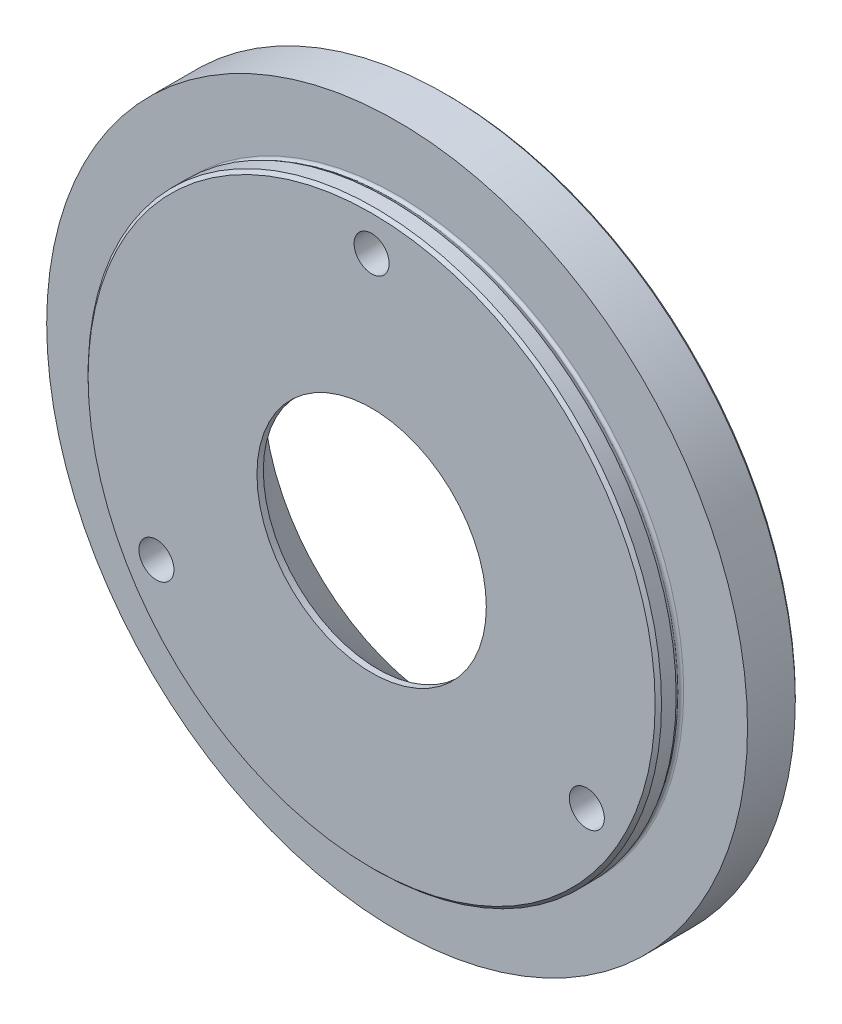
ISO-10303-21;
HEADER;
FILE_DESCRIPTION(('STEP AP214'),'2;1');
FILE_NAME('part.step','',(''),(''),'','','');
FILE_SCHEMA(('AUTOMOTIVE_DESIGN { 1 0 10303 214 1 1 1 1 }'));
ENDSEC;
DATA;
#1=APPLICATION_CONTEXT('core data for automotive mechanical design processes');
#2=APPLICATION_PROTOCOL_DEFINITION('international standard','automotive_design',2000,#1);
#3=PRODUCT_CONTEXT('',#1,'mechanical');
#4=PRODUCT('Part','Part','',(#3));
#5=PRODUCT_RELATED_PRODUCT_CATEGORY('part','',(#4));
#6=PRODUCT_DEFINITION_FORMATION('','',#4);
#7=PRODUCT_DEFINITION_CONTEXT('part definition',#1,'design');
#8=PRODUCT_DEFINITION('design','',#6,#7);
#9=PRODUCT_DEFINITION_SHAPE('','',#8);
#10=(LENGTH_UNIT() NAMED_UNIT(*) SI_UNIT(.MILLI.,.METRE.));
#11=(NAMED_UNIT(*) PLANE_ANGLE_UNIT() SI_UNIT($,.RADIAN.));
#12=(NAMED_UNIT(*) SI_UNIT($,.STERADIAN.) SOLID_ANGLE_UNIT());
#13=UNCERTAINTY_MEASURE_WITH_UNIT(LENGTH_MEASURE(1.E-05),#10,'distance_accuracy_value','');
#14=(GEOMETRIC_REPRESENTATION_CONTEXT(3) GLOBAL_UNCERTAINTY_ASSIGNED_CONTEXT((#13)) GLOBAL_UNIT_ASSIGNED_CONTEXT((#10,
#11,#12)) REPRESENTATION_CONTEXT('',''));
#15=CARTESIAN_POINT('',(0.,0.,0.));
#16=DIRECTION('',(0.,0.,1.));
#17=DIRECTION('',(1.,0.,0.));
#18=AXIS2_PLACEMENT_3D('',#15,#16,#17);
#19=CARTESIAN_POINT('',(0.,0.,4.));
#20=DIRECTION('',(0.,0.,1.));
#21=DIRECTION('',(1.,0.,0.));
#22=AXIS2_PLACEMENT_3D('',#19,#20,#21);
#23=CYLINDRICAL_SURFACE('',#22,45.);
#24=CARTESIAN_POINT('',(0.,0.,3.49999999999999));
#25=DIRECTION('',(0.,0.,1.));
#26=DIRECTION('',(1.,0.,0.));
#27=AXIS2_PLACEMENT_3D('',#24,#25,#26);
#28=CIRCLE('',#27,45.);
#29=CARTESIAN_POINT('',(45.,0.,3.49999999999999));
#30=VERTEX_POINT('',#29);
#31=EDGE_CURVE('E47',#30,#30,#28,.T.);
#32=ORIENTED_EDGE('',*,*,#31,.F.);
#33=EDGE_LOOP('',(#32));
#34=FACE_BOUND('',#33,.T.);
#35=CARTESIAN_POINT('',(0.,0.,1.2));
#36=DIRECTION('',(0.,0.,1.));
#37=DIRECTION('',(1.,0.,0.));
#38=AXIS2_PLACEMENT_3D('',#35,#36,#37);
#39=CIRCLE('',#38,45.);
#40=CARTESIAN_POINT('',(45.,0.,1.2));
#41=VERTEX_POINT('',#40);
#42=EDGE_CURVE('E70',#41,#41,#39,.T.);
#43=ORIENTED_EDGE('',*,*,#42,.T.);
#44=EDGE_LOOP('',(#43));
#45=FACE_BOUND('',#44,.T.);
#46=ADVANCED_FACE('F32',(#34,#45),#23,.T.);
#47=CARTESIAN_POINT('',(0.,44.5,4.));
#48=DIRECTION('',(0.,0.,-1.));
#49=DIRECTION('',(-1.,0.,0.));
#50=AXIS2_PLACEMENT_3D('',#47,#48,#49);
#51=PLANE('',#50);
#52=CARTESIAN_POINT('',(0.,39.,4.));
#53=DIRECTION('',(0.,0.,-1.));
#54=DIRECTION('',(-1.,0.,0.));
#55=AXIS2_PLACEMENT_3D('',#52,#53,#54);
#56=CIRCLE('',#55,2.75);
#57=CARTESIAN_POINT('',(-2.75000000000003,39.,4.));
#58=VERTEX_POINT('',#57);
#59=EDGE_CURVE('E97',#58,#58,#56,.T.);
#60=ORIENTED_EDGE('',*,*,#59,.T.);
#61=EDGE_LOOP('',(#60));
#62=FACE_BOUND('',#61,.T.);
#63=CARTESIAN_POINT('',(-33.7749907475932,-19.5,4.));
#64=DIRECTION('',(0.,0.,-1.));
#65=DIRECTION('',(-1.,0.,0.));
#66=AXIS2_PLACEMENT_3D('',#63,#64,#65);
#67=CIRCLE('',#66,2.75);
#68=CARTESIAN_POINT('',(-36.5249907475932,-19.5,4.));
#69=VERTEX_POINT('',#68);
#70=EDGE_CURVE('E85',#69,#69,#67,.T.);
#71=ORIENTED_EDGE('',*,*,#70,.T.);
#72=EDGE_LOOP('',(#71));
#73=FACE_BOUND('',#72,.T.);
#74=CARTESIAN_POINT('',(33.7749907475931,-19.5,4.));
#75=DIRECTION('',(0.,0.,-1.));
#76=DIRECTION('',(-1.,0.,0.));
#77=AXIS2_PLACEMENT_3D('',#74,#75,#76);
#78=CIRCLE('',#77,2.75);
#79=CARTESIAN_POINT('',(31.0249907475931,-19.5,4.));
#80=VERTEX_POINT('',#79);
#81=EDGE_CURVE('E73',#80,#80,#78,.T.);
#82=ORIENTED_EDGE('',*,*,#81,.T.);
#83=EDGE_LOOP('',(#82));
#84=FACE_BOUND('',#83,.T.);
#85=CARTESIAN_POINT('',(0.,0.,4.));
#86=DIRECTION('',(0.,0.,1.));
#87=DIRECTION('',(1.,0.,0.));
#88=AXIS2_PLACEMENT_3D('',#85,#86,#87);
#89=CIRCLE('',#88,18.);
#90=CARTESIAN_POINT('',(18.,0.,4.));
#91=VERTEX_POINT('',#90);
#92=EDGE_CURVE('E10',#91,#91,#89,.T.);
#93=ORIENTED_EDGE('',*,*,#92,.F.);
#94=EDGE_LOOP('',(#93));
#95=FACE_BOUND('',#94,.T.);
#96=CARTESIAN_POINT('',(0.,0.,4.));
#97=DIRECTION('',(0.,0.,1.));
#98=DIRECTION('',(1.,0.,0.));
#99=AXIS2_PLACEMENT_3D('',#96,#97,#98);
#100=CIRCLE('',#99,44.5);
#101=CARTESIAN_POINT('',(44.5,0.,4.));
#102=VERTEX_POINT('',#101);
#103=EDGE_CURVE('E52',#102,#102,#100,.T.);
#104=ORIENTED_EDGE('',*,*,#103,.T.);
#105=EDGE_LOOP('',(#104));
#106=FACE_BOUND('',#105,.T.);
#107=ADVANCED_FACE('F34',(#62,#73,#84,#95,#106),#51,.F.);
#108=CARTESIAN_POINT('',(0.,0.,4.));
#109=DIRECTION('',(0.,0.,1.));
#110=DIRECTION('',(1.,0.,0.));
#111=AXIS2_PLACEMENT_3D('',#108,#109,#110);
#112=CYLINDRICAL_SURFACE('',#111,18.);
#113=CARTESIAN_POINT('',(0.,0.,3.));
#114=DIRECTION('',(0.,0.,1.));
#115=DIRECTION('',(1.,0.,0.));
#116=AXIS2_PLACEMENT_3D('',#113,#114,#115);
#117=CIRCLE('',#116,18.);
#118=CARTESIAN_POINT('',(18.,0.,3.));
#119=VERTEX_POINT('',#118);
#120=EDGE_CURVE('E39',#119,#119,#117,.T.);
#121=ORIENTED_EDGE('',*,*,#120,.F.);
#122=EDGE_LOOP('',(#121));
#123=FACE_BOUND('',#122,.T.);
#124=ORIENTED_EDGE('',*,*,#92,.T.);
#125=EDGE_LOOP('',(#124));
#126=FACE_BOUND('',#125,.T.);
#127=ADVANCED_FACE('F149',(#123,#126),#112,.F.);
#128=CARTESIAN_POINT('',(0.,0.,3.));
#129=DIRECTION('',(0.,0.,-1.));
#130=DIRECTION('',(-1.,0.,0.));
#131=AXIS2_PLACEMENT_3D('',#128,#129,#130);
#132=CONICAL_SURFACE('',#131,18.,0.785398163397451);
#133=CARTESIAN_POINT('',(0.,0.,-8.));
#134=DIRECTION('',(0.,0.,1.));
#135=DIRECTION('',(1.,0.,0.));
#136=AXIS2_PLACEMENT_3D('',#133,#134,#135);
#137=CIRCLE('',#136,29.0000000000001);
#138=CARTESIAN_POINT('',(29.,0.,-8.));
#139=VERTEX_POINT('',#138);
#140=EDGE_CURVE('E43',#139,#139,#137,.T.);
#141=ORIENTED_EDGE('',*,*,#140,.F.);
#142=EDGE_LOOP('',(#141));
#143=FACE_BOUND('',#142,.T.);
#144=ORIENTED_EDGE('',*,*,#120,.T.);
#145=EDGE_LOOP('',(#144));
#146=FACE_BOUND('',#145,.T.);
#147=ADVANCED_FACE('F116',(#143,#146),#132,.F.);
#148=CARTESIAN_POINT('',(0.,29.0000000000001,-8.));
#149=DIRECTION('',(0.,0.,1.));
#150=DIRECTION('',(1.,0.,0.));
#151=AXIS2_PLACEMENT_3D('',#148,#149,#150);
#152=PLANE('',#151);
#153=CARTESIAN_POINT('',(0.,39.,-8.));
#154=DIRECTION('',(0.,0.,-1.));
#155=DIRECTION('',(-1.,0.,0.));
#156=AXIS2_PLACEMENT_3D('',#153,#154,#155);
#157=CIRCLE('',#156,5.);
#158=CARTESIAN_POINT('',(-5.00000000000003,39.,-8.));
#159=VERTEX_POINT('',#158);
#160=EDGE_CURVE('E106',#159,#159,#157,.T.);
#161=ORIENTED_EDGE('',*,*,#160,.F.);
#162=EDGE_LOOP('',(#161));
#163=FACE_BOUND('',#162,.T.);
#164=CARTESIAN_POINT('',(-33.7749907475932,-19.5,-8.));
#165=DIRECTION('',(0.,0.,-1.));
#166=DIRECTION('',(-1.,0.,0.));
#167=AXIS2_PLACEMENT_3D('',#164,#165,#166);
#168=CIRCLE('',#167,5.);
#169=CARTESIAN_POINT('',(-38.7749907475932,-19.5,-8.));
#170=VERTEX_POINT('',#169);
#171=EDGE_CURVE('E94',#170,#170,#168,.T.);
#172=ORIENTED_EDGE('',*,*,#171,.F.);
#173=EDGE_LOOP('',(#172));
#174=FACE_BOUND('',#173,.T.);
#175=CARTESIAN_POINT('',(33.7749907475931,-19.5,-8.));
#176=DIRECTION('',(0.,0.,-1.));
#177=DIRECTION('',(-1.,0.,0.));
#178=AXIS2_PLACEMENT_3D('',#175,#176,#177);
#179=CIRCLE('',#178,5.);
#180=CARTESIAN_POINT('',(28.7749907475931,-19.5,-8.));
#181=VERTEX_POINT('',#180);
#182=EDGE_CURVE('E82',#181,#181,#179,.T.);
#183=ORIENTED_EDGE('',*,*,#182,.F.);
#184=EDGE_LOOP('',(#183));
#185=FACE_BOUND('',#184,.T.);
#186=ORIENTED_EDGE('',*,*,#140,.T.);
#187=EDGE_LOOP('',(#186));
#188=FACE_BOUND('',#187,.T.);
#189=CARTESIAN_POINT('',(0.,0.,-8.));
#190=DIRECTION('',(0.,0.,1.));
#191=DIRECTION('',(1.,0.,0.));
#192=AXIS2_PLACEMENT_3D('',#189,#190,#191);
#193=CIRCLE('',#192,54.5);
#194=CARTESIAN_POINT('',(54.4999999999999,0.,-8.));
#195=VERTEX_POINT('',#194);
#196=EDGE_CURVE('E61',#195,#195,#193,.T.);
#197=ORIENTED_EDGE('',*,*,#196,.F.);
#198=EDGE_LOOP('',(#197));
#199=FACE_BOUND('',#198,.T.);
#200=ADVANCED_FACE('F112',(#163,#174,#185,#188,#199),#152,.F.);
#201=CARTESIAN_POINT('',(0.,0.,3.49999999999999));
#202=DIRECTION('',(0.,0.,-1.));
#203=DIRECTION('',(-1.,0.,0.));
#204=AXIS2_PLACEMENT_3D('',#201,#202,#203);
#205=CONICAL_SURFACE('',#204,45.,0.785398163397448);
#206=ORIENTED_EDGE('',*,*,#103,.F.);
#207=EDGE_LOOP('',(#206));
#208=FACE_BOUND('',#207,.T.);
#209=ORIENTED_EDGE('',*,*,#31,.T.);
#210=EDGE_LOOP('',(#209));
#211=FACE_BOUND('',#210,.T.);
#212=ADVANCED_FACE('F115',(#208,#211),#205,.T.);
#213=CARTESIAN_POINT('',(0.,45.,0.));
#214=DIRECTION('',(0.,0.,-1.));
#215=DIRECTION('',(-1.,0.,0.));
#216=AXIS2_PLACEMENT_3D('',#213,#214,#215);
#217=PLANE('',#216);
#218=CARTESIAN_POINT('',(0.,0.,0.));
#219=DIRECTION('',(0.,0.,1.));
#220=DIRECTION('',(1.,0.,0.));
#221=AXIS2_PLACEMENT_3D('',#218,#219,#220);
#222=CIRCLE('',#221,55.);
#223=CARTESIAN_POINT('',(55.,0.,0.));
#224=VERTEX_POINT('',#223);
#225=EDGE_CURVE('E55',#224,#224,#222,.T.);
#226=ORIENTED_EDGE('',*,*,#225,.T.);
#227=EDGE_LOOP('',(#226));
#228=FACE_BOUND('',#227,.T.);
#229=CARTESIAN_POINT('',(0.,0.,0.));
#230=DIRECTION('',(0.,0.,1.));
#231=DIRECTION('',(1.,0.,0.));
#232=AXIS2_PLACEMENT_3D('',#229,#230,#231);
#233=CIRCLE('',#232,44.9859648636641);
#234=CARTESIAN_POINT('',(44.9859648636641,0.,0.));
#235=VERTEX_POINT('',#234);
#236=EDGE_CURVE('E64',#235,#235,#233,.T.);
#237=ORIENTED_EDGE('',*,*,#236,.F.);
#238=EDGE_LOOP('',(#237));
#239=FACE_BOUND('',#238,.T.);
#240=ADVANCED_FACE('F139',(#228,#239),#217,.F.);
#241=CARTESIAN_POINT('',(0.,0.,4.));
#242=DIRECTION('',(0.,0.,1.));
#243=DIRECTION('',(1.,0.,0.));
#244=AXIS2_PLACEMENT_3D('',#241,#242,#243);
#245=CYLINDRICAL_SURFACE('',#244,55.);
#246=ORIENTED_EDGE('',*,*,#225,.F.);
#247=EDGE_LOOP('',(#246));
#248=FACE_BOUND('',#247,.T.);
#249=CARTESIAN_POINT('',(0.,0.,-7.49999999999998));
#250=DIRECTION('',(0.,0.,1.));
#251=DIRECTION('',(1.,0.,0.));
#252=AXIS2_PLACEMENT_3D('',#249,#250,#251);
#253=CIRCLE('',#252,55.);
#254=CARTESIAN_POINT('',(55.,0.,-7.49999999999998));
#255=VERTEX_POINT('',#254);
#256=EDGE_CURVE('E58',#255,#255,#253,.T.);
#257=ORIENTED_EDGE('',*,*,#256,.T.);
#258=EDGE_LOOP('',(#257));
#259=FACE_BOUND('',#258,.T.);
#260=ADVANCED_FACE('F129',(#248,#259),#245,.T.);
#261=CARTESIAN_POINT('',(0.,0.,-8.));
#262=DIRECTION('',(0.,0.,1.));
#263=DIRECTION('',(1.,0.,0.));
#264=AXIS2_PLACEMENT_3D('',#261,#262,#263);
#265=CONICAL_SURFACE('',#264,54.5,0.785398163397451);
#266=ORIENTED_EDGE('',*,*,#256,.F.);
#267=EDGE_LOOP('',(#266));
#268=FACE_BOUND('',#267,.T.);
#269=ORIENTED_EDGE('',*,*,#196,.T.);
#270=EDGE_LOOP('',(#269));
#271=FACE_BOUND('',#270,.T.);
#272=ADVANCED_FACE('F126',(#268,#271),#265,.T.);
#273=CARTESIAN_POINT('',(0.,0.,0.400000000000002));
#274=DIRECTION('',(0.,0.,1.));
#275=DIRECTION('',(1.,0.,0.));
#276=AXIS2_PLACEMENT_3D('',#273,#274,#275);
#277=TOROIDAL_SURFACE('',#276,44.9859648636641,0.400000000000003);
#278=ORIENTED_EDGE('',*,*,#236,.T.);
#279=EDGE_LOOP('',(#278));
#280=FACE_BOUND('',#279,.T.);
#281=CARTESIAN_POINT('',(0.,0.,0.606015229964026));
#282=DIRECTION('',(0.,0.,1.));
#283=DIRECTION('',(1.,0.,0.));
#284=AXIS2_PLACEMENT_3D('',#281,#282,#283);
#285=CIRCLE('',#284,44.6430979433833);
#286=CARTESIAN_POINT('',(44.6430979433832,0.,0.606015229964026));
#287=VERTEX_POINT('',#286);
#288=EDGE_CURVE('E67',#287,#287,#285,.T.);
#289=ORIENTED_EDGE('',*,*,#288,.F.);
#290=EDGE_LOOP('',(#289));
#291=FACE_BOUND('',#290,.T.);
#292=ADVANCED_FACE('F128',(#280,#291),#277,.F.);
#293=CARTESIAN_POINT('',(0.,0.,1.2));
#294=DIRECTION('',(0.,0.,1.));
#295=DIRECTION('',(1.,0.,0.));
#296=AXIS2_PLACEMENT_3D('',#293,#294,#295);
#297=CONICAL_SURFACE('',#296,45.,0.541052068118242);
#298=ORIENTED_EDGE('',*,*,#288,.T.);
#299=EDGE_LOOP('',(#298));
#300=FACE_BOUND('',#299,.T.);
#301=ORIENTED_EDGE('',*,*,#42,.F.);
#302=EDGE_LOOP('',(#301));
#303=FACE_BOUND('',#302,.T.);
#304=ADVANCED_FACE('F136',(#300,#303),#297,.T.);
#305=CARTESIAN_POINT('',(33.7749907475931,-19.5,-8.));
#306=DIRECTION('',(0.,0.,-1.));
#307=DIRECTION('',(-1.,0.,0.));
#308=AXIS2_PLACEMENT_3D('',#305,#306,#307);
#309=CYLINDRICAL_SURFACE('',#308,2.75);
#310=ORIENTED_EDGE('',*,*,#81,.F.);
#311=EDGE_LOOP('',(#310));
#312=FACE_BOUND('',#311,.T.);
#313=CARTESIAN_POINT('',(33.7749907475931,-19.5,-2.3));
#314=DIRECTION('',(0.,0.,-1.));
#315=DIRECTION('',(-1.,0.,0.));
#316=AXIS2_PLACEMENT_3D('',#313,#314,#315);
#317=CIRCLE('',#316,2.75);
#318=CARTESIAN_POINT('',(31.0249907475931,-19.5,-2.3));
#319=VERTEX_POINT('',#318);
#320=EDGE_CURVE('E76',#319,#319,#317,.T.);
#321=ORIENTED_EDGE('',*,*,#320,.T.);
#322=EDGE_LOOP('',(#321));
#323=FACE_BOUND('',#322,.T.);
#324=ADVANCED_FACE('F217',(#312,#323),#309,.F.);
#325=CARTESIAN_POINT('',(36.5249907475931,-19.5,-2.3));
#326=DIRECTION('',(0.,0.,1.));
#327=DIRECTION('',(1.,0.,0.));
#328=AXIS2_PLACEMENT_3D('',#325,#326,#327);
#329=PLANE('',#328);
#330=ORIENTED_EDGE('',*,*,#320,.F.);
#331=EDGE_LOOP('',(#330));
#332=FACE_BOUND('',#331,.T.);
#333=CARTESIAN_POINT('',(33.7749907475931,-19.5,-2.3));
#334=DIRECTION('',(0.,0.,-1.));
#335=DIRECTION('',(-1.,0.,0.));
#336=AXIS2_PLACEMENT_3D('',#333,#334,#335);
#337=CIRCLE('',#336,5.);
#338=CARTESIAN_POINT('',(28.7749907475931,-19.5,-2.3));
#339=VERTEX_POINT('',#338);
#340=EDGE_CURVE('E79',#339,#339,#337,.T.);
#341=ORIENTED_EDGE('',*,*,#340,.T.);
#342=EDGE_LOOP('',(#341));
#343=FACE_BOUND('',#342,.T.);
#344=ADVANCED_FACE('F225',(#332,#343),#329,.F.);
#345=CARTESIAN_POINT('',(33.7749907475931,-19.5,-8.));
#346=DIRECTION('',(0.,0.,-1.));
#347=DIRECTION('',(-1.,0.,0.));
#348=AXIS2_PLACEMENT_3D('',#345,#346,#347);
#349=CYLINDRICAL_SURFACE('',#348,5.);
#350=ORIENTED_EDGE('',*,*,#340,.F.);
#351=EDGE_LOOP('',(#350));
#352=FACE_BOUND('',#351,.T.);
#353=ORIENTED_EDGE('',*,*,#182,.T.);
#354=EDGE_LOOP('',(#353));
#355=FACE_BOUND('',#354,.T.);
#356=ADVANCED_FACE('F234',(#352,#355),#349,.F.);
#357=CARTESIAN_POINT('',(-33.7749907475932,-19.5,-8.));
#358=DIRECTION('',(0.,0.,-1.));
#359=DIRECTION('',(-1.,0.,0.));
#360=AXIS2_PLACEMENT_3D('',#357,#358,#359);
#361=CYLINDRICAL_SURFACE('',#360,2.75);
#362=ORIENTED_EDGE('',*,*,#70,.F.);
#363=EDGE_LOOP('',(#362));
#364=FACE_BOUND('',#363,.T.);
#365=CARTESIAN_POINT('',(-33.7749907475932,-19.5,-2.3));
#366=DIRECTION('',(0.,0.,-1.));
#367=DIRECTION('',(-1.,0.,0.));
#368=AXIS2_PLACEMENT_3D('',#365,#366,#367);
#369=CIRCLE('',#368,2.75);
#370=CARTESIAN_POINT('',(-36.5249907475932,-19.5,-2.3));
#371=VERTEX_POINT('',#370);
#372=EDGE_CURVE('E88',#371,#371,#369,.T.);
#373=ORIENTED_EDGE('',*,*,#372,.T.);
#374=EDGE_LOOP('',(#373));
#375=FACE_BOUND('',#374,.T.);
#376=ADVANCED_FACE('F243',(#364,#375),#361,.F.);
#377=CARTESIAN_POINT('',(-31.0249907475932,-19.5,-2.3));
#378=DIRECTION('',(0.,0.,1.));
#379=DIRECTION('',(1.,0.,0.));
#380=AXIS2_PLACEMENT_3D('',#377,#378,#379);
#381=PLANE('',#380);
#382=ORIENTED_EDGE('',*,*,#372,.F.);
#383=EDGE_LOOP('',(#382));
#384=FACE_BOUND('',#383,.T.);
#385=CARTESIAN_POINT('',(-33.7749907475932,-19.5,-2.3));
#386=DIRECTION('',(0.,0.,-1.));
#387=DIRECTION('',(-1.,0.,0.));
#388=AXIS2_PLACEMENT_3D('',#385,#386,#387);
#389=CIRCLE('',#388,5.);
#390=CARTESIAN_POINT('',(-38.7749907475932,-19.5,-2.3));
#391=VERTEX_POINT('',#390);
#392=EDGE_CURVE('E91',#391,#391,#389,.T.);
#393=ORIENTED_EDGE('',*,*,#392,.T.);
#394=EDGE_LOOP('',(#393));
#395=FACE_BOUND('',#394,.T.);
#396=ADVANCED_FACE('F252',(#384,#395),#381,.F.);
#397=CARTESIAN_POINT('',(-33.7749907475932,-19.5,-8.));
#398=DIRECTION('',(0.,0.,-1.));
#399=DIRECTION('',(-1.,0.,0.));
#400=AXIS2_PLACEMENT_3D('',#397,#398,#399);
#401=CYLINDRICAL_SURFACE('',#400,5.);
#402=ORIENTED_EDGE('',*,*,#392,.F.);
#403=EDGE_LOOP('',(#402));
#404=FACE_BOUND('',#403,.T.);
#405=ORIENTED_EDGE('',*,*,#171,.T.);
#406=EDGE_LOOP('',(#405));
#407=FACE_BOUND('',#406,.T.);
#408=ADVANCED_FACE('F261',(#404,#407),#401,.F.);
#409=CARTESIAN_POINT('',(0.,39.,-8.));
#410=DIRECTION('',(0.,0.,-1.));
#411=DIRECTION('',(-1.,0.,0.));
#412=AXIS2_PLACEMENT_3D('',#409,#410,#411);
#413=CYLINDRICAL_SURFACE('',#412,2.75);
#414=ORIENTED_EDGE('',*,*,#59,.F.);
#415=EDGE_LOOP('',(#414));
#416=FACE_BOUND('',#415,.T.);
#417=CARTESIAN_POINT('',(0.,39.,-2.3));
#418=DIRECTION('',(0.,0.,-1.));
#419=DIRECTION('',(-1.,0.,0.));
#420=AXIS2_PLACEMENT_3D('',#417,#418,#419);
#421=CIRCLE('',#420,2.75);
#422=CARTESIAN_POINT('',(-2.75000000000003,39.,-2.3));
#423=VERTEX_POINT('',#422);
#424=EDGE_CURVE('E100',#423,#423,#421,.T.);
#425=ORIENTED_EDGE('',*,*,#424,.T.);
#426=EDGE_LOOP('',(#425));
#427=FACE_BOUND('',#426,.T.);
#428=ADVANCED_FACE('F270',(#416,#427),#413,.F.);
#429=CARTESIAN_POINT('',(2.74999999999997,39.,-2.3));
#430=DIRECTION('',(0.,0.,1.));
#431=DIRECTION('',(1.,0.,0.));
#432=AXIS2_PLACEMENT_3D('',#429,#430,#431);
#433=PLANE('',#432);
#434=ORIENTED_EDGE('',*,*,#424,.F.);
#435=EDGE_LOOP('',(#434));
#436=FACE_BOUND('',#435,.T.);
#437=CARTESIAN_POINT('',(0.,39.,-2.3));
#438=DIRECTION('',(0.,0.,-1.));
#439=DIRECTION('',(-1.,0.,0.));
#440=AXIS2_PLACEMENT_3D('',#437,#438,#439);
#441=CIRCLE('',#440,5.);
#442=CARTESIAN_POINT('',(-5.00000000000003,39.,-2.3));
#443=VERTEX_POINT('',#442);
#444=EDGE_CURVE('E103',#443,#443,#441,.T.);
#445=ORIENTED_EDGE('',*,*,#444,.T.);
#446=EDGE_LOOP('',(#445));
#447=FACE_BOUND('',#446,.T.);
#448=ADVANCED_FACE('F279',(#436,#447),#433,.F.);
#449=CARTESIAN_POINT('',(0.,39.,-8.));
#450=DIRECTION('',(0.,0.,-1.));
#451=DIRECTION('',(-1.,0.,0.));
#452=AXIS2_PLACEMENT_3D('',#449,#450,#451);
#453=CYLINDRICAL_SURFACE('',#452,5.);
#454=ORIENTED_EDGE('',*,*,#444,.F.);
#455=EDGE_LOOP('',(#454));
#456=FACE_BOUND('',#455,.T.);
#457=ORIENTED_EDGE('',*,*,#160,.T.);
#458=EDGE_LOOP('',(#457));
#459=FACE_BOUND('',#458,.T.);
#460=ADVANCED_FACE('F110',(#456,#459),#453,.F.);
#461=CLOSED_SHELL('',(#46,#107,#127,#147,#200,#212,#240,#260,#272,#292,#304,#324,#344,#356,#376,
#396,#408,#428,#448,#460));
#462=MANIFOLD_SOLID_BREP('B2',#461);
#463=ADVANCED_BREP_SHAPE_REPRESENTATION('',(#18,#462),#14);
#464=SHAPE_DEFINITION_REPRESENTATION(#9,#463);
ENDSEC;
END-ISO-10303-21;
